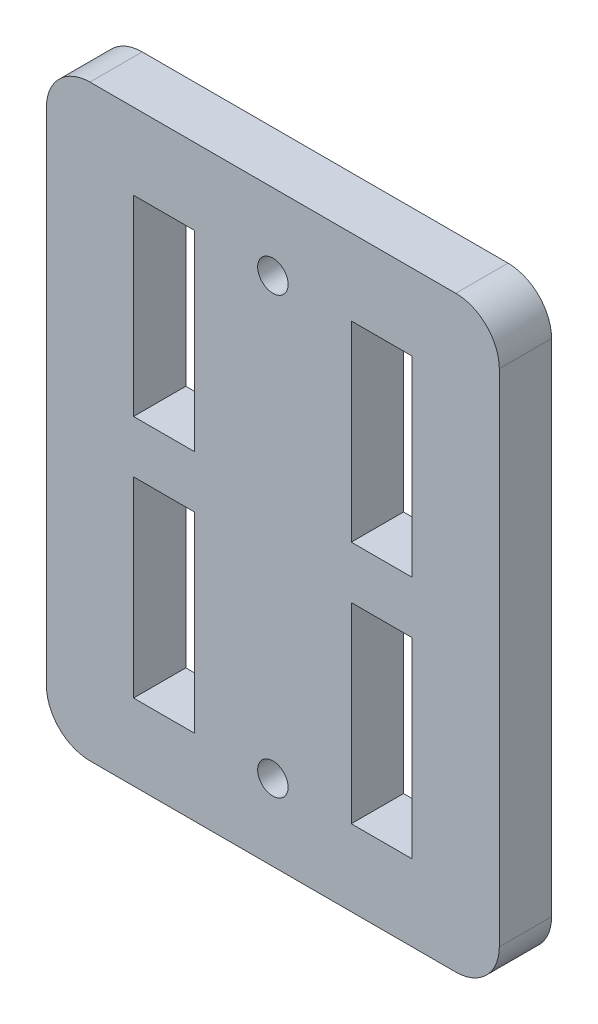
from build123d import *

# Parameters (mm, degrees)
SKETCH_1_R      = 1.75
SKETCH_1_W      = 7
SKETCH_1_H      = 22
EXTRUDE_1_DEPTH = 6


with BuildPart() as part:
    # Sketch 1 → Extrude 1 (new body)
    with BuildSketch(Plane(origin=(0, 0, -3), x_dir=(-1, 0, 0), z_dir=(0, 0, -1))):
        with BuildLine():
            Line((-21, -33.75), (21, -33.75))
            ThreePointArc((21, -33.75), (24.535533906, -32.285533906), (26, -28.75))
            Line((26, -28.75), (26, 28.75))
            ThreePointArc((26, 28.75), (24.535533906, 32.285533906), (21, 33.75))
            Line((21, 33.75), (-21, 33.75))
            ThreePointArc((-21, 33.75), (-24.535533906, 32.285533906), (-26, 28.75))
            Line((-26, 28.75), (-26, -28.75))
            ThreePointArc((-26, -28.75), (-24.535533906, -32.285533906), (-21, -33.75))
        make_face()
        with Locations(Location((0, 25, 0), (0, 0, 180))):
            Circle(SKETCH_1_R, mode=Mode.SUBTRACT)
        with Locations(Location((0, -25, 0), (0, 0, 180))):
            Circle(SKETCH_1_R, mode=Mode.SUBTRACT)
        with Locations((12.5, 14)):
            Rectangle(SKETCH_1_W, SKETCH_1_H, mode=Mode.SUBTRACT)
        with Locations((-12.5, 14)):
            Rectangle(SKETCH_1_W, SKETCH_1_H, mode=Mode.SUBTRACT)
        with Locations((-12.5, -14)):
            Rectangle(SKETCH_1_W, SKETCH_1_H, mode=Mode.SUBTRACT)
        with Locations((12.5, -14)):
            Rectangle(SKETCH_1_W, SKETCH_1_H, mode=Mode.SUBTRACT)
    extrude(amount=-EXTRUDE_1_DEPTH)


solid = part.part
